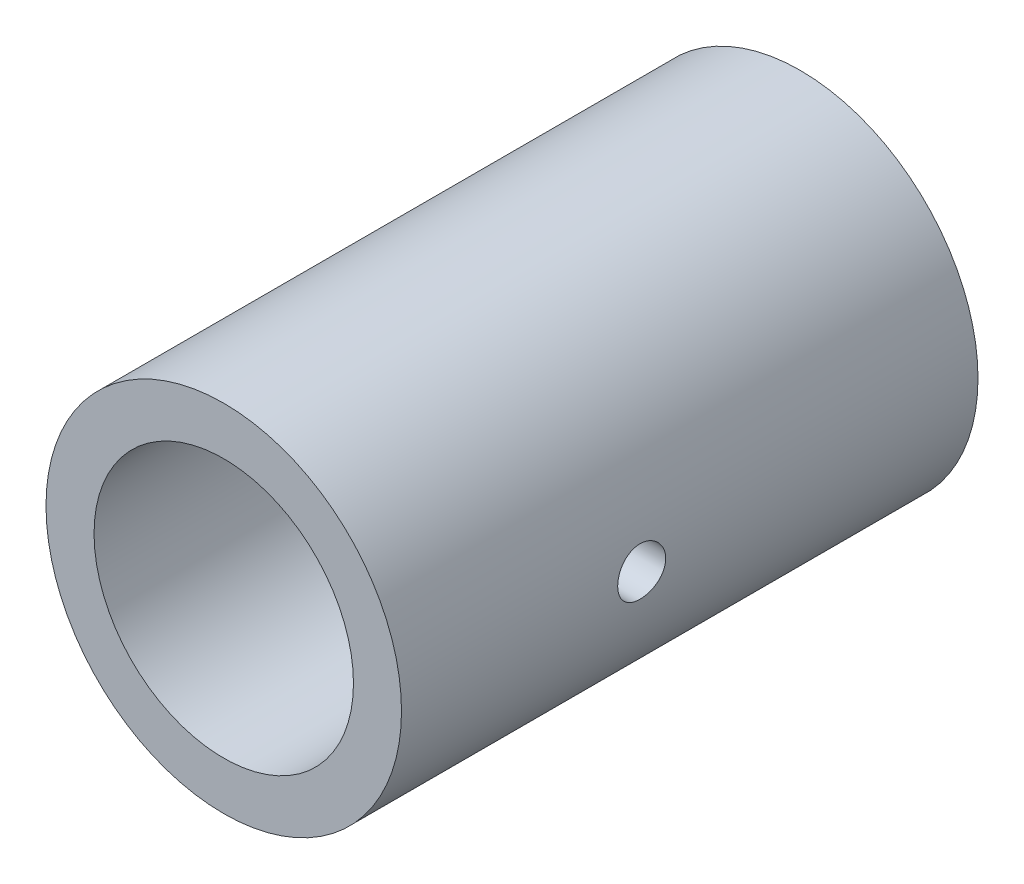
ISO-10303-21;
HEADER;
FILE_DESCRIPTION(('STEP AP214'),'2;1');
FILE_NAME('part.step','',(''),(''),'','','');
FILE_SCHEMA(('AUTOMOTIVE_DESIGN { 1 0 10303 214 1 1 1 1 }'));
ENDSEC;
DATA;
#1=APPLICATION_CONTEXT('core data for automotive mechanical design processes');
#2=APPLICATION_PROTOCOL_DEFINITION('international standard','automotive_design',2000,#1);
#3=PRODUCT_CONTEXT('',#1,'mechanical');
#4=PRODUCT('Part','Part','',(#3));
#5=PRODUCT_RELATED_PRODUCT_CATEGORY('part','',(#4));
#6=PRODUCT_DEFINITION_FORMATION('','',#4);
#7=PRODUCT_DEFINITION_CONTEXT('part definition',#1,'design');
#8=PRODUCT_DEFINITION('design','',#6,#7);
#9=PRODUCT_DEFINITION_SHAPE('','',#8);
#10=(LENGTH_UNIT() NAMED_UNIT(*) SI_UNIT(.MILLI.,.METRE.));
#11=(NAMED_UNIT(*) PLANE_ANGLE_UNIT() SI_UNIT($,.RADIAN.));
#12=(NAMED_UNIT(*) SI_UNIT($,.STERADIAN.) SOLID_ANGLE_UNIT());
#13=UNCERTAINTY_MEASURE_WITH_UNIT(LENGTH_MEASURE(1.E-05),#10,'distance_accuracy_value','');
#14=(GEOMETRIC_REPRESENTATION_CONTEXT(3) GLOBAL_UNCERTAINTY_ASSIGNED_CONTEXT((#13)) GLOBAL_UNIT_ASSIGNED_CONTEXT((#10,
#11,#12)) REPRESENTATION_CONTEXT('',''));
#15=CARTESIAN_POINT('',(0.,0.,0.));
#16=DIRECTION('',(0.,0.,1.));
#17=DIRECTION('',(1.,0.,0.));
#18=AXIS2_PLACEMENT_3D('',#15,#16,#17);
#19=CARTESIAN_POINT('',(0.,0.,65.));
#20=DIRECTION('',(0.,0.,-1.));
#21=DIRECTION('',(-1.,0.,0.));
#22=AXIS2_PLACEMENT_3D('',#19,#20,#21);
#23=CYLINDRICAL_SURFACE('',#22,18.5);
#24=CARTESIAN_POINT('',(18.5,0.,37.5));
#25=CARTESIAN_POINT('',(18.4999979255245,-0.139743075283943,37.5000058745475));
#26=CARTESIAN_POINT('',(18.498399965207,-0.279571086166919,37.5117564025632));
#27=CARTESIAN_POINT('',(18.4921791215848,-0.555329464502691,37.558442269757));
#28=CARTESIAN_POINT('',(18.4875531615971,-0.691255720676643,37.5934011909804));
#29=CARTESIAN_POINT('',(18.4757969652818,-0.955179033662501,37.685449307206));
#30=CARTESIAN_POINT('',(18.4686684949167,-1.08318160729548,37.7425228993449));
#31=CARTESIAN_POINT('',(18.4526981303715,-1.32776976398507,37.8771445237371));
#32=CARTESIAN_POINT('',(18.4438565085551,-1.44435715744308,37.9546893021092));
#33=CARTESIAN_POINT('',(18.4253822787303,-1.66357332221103,38.1285813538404));
#34=CARTESIAN_POINT('',(18.4157454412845,-1.76611856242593,38.2250334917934));
#35=CARTESIAN_POINT('',(18.3968006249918,-1.95361961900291,38.4337769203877));
#36=CARTESIAN_POINT('',(18.3874926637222,-2.03857449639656,38.546069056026));
#37=CARTESIAN_POINT('',(18.3702181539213,-2.18880006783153,38.7838551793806));
#38=CARTESIAN_POINT('',(18.3622570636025,-2.25399147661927,38.909399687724));
#39=CARTESIAN_POINT('',(18.34863433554,-2.36233311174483,39.1697808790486));
#40=CARTESIAN_POINT('',(18.3429725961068,-2.40548431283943,39.3046171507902));
#41=CARTESIAN_POINT('',(18.3346305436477,-2.46826453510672,39.5788825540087));
#42=CARTESIAN_POINT('',(18.3319322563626,-2.48803542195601,39.7182786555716));
#43=CARTESIAN_POINT('',(18.3297678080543,-2.5039329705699,39.9984342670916));
#44=CARTESIAN_POINT('',(18.3303014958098,-2.5000607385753,40.1391937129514));
#45=CARTESIAN_POINT('',(18.3345242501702,-2.46889821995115,40.4170865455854));
#46=CARTESIAN_POINT('',(18.3381921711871,-2.44176486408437,40.5542378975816));
#47=CARTESIAN_POINT('',(18.3482371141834,-2.36509547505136,40.8220228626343));
#48=CARTESIAN_POINT('',(18.3546141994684,-2.3155589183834,40.9526563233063));
#49=CARTESIAN_POINT('',(18.3693826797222,-2.19532271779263,41.2041809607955));
#50=CARTESIAN_POINT('',(18.3777804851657,-2.12455554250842,41.3250394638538));
#51=CARTESIAN_POINT('',(18.39563936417,-1.96391514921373,41.5532251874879));
#52=CARTESIAN_POINT('',(18.4051004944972,-1.87404091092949,41.6605516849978));
#53=CARTESIAN_POINT('',(18.4241137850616,-1.67687105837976,41.8595371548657));
#54=CARTESIAN_POINT('',(18.4336660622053,-1.56944030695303,41.9510622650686));
#55=CARTESIAN_POINT('',(18.4517139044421,-1.34067046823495,42.1148023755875));
#56=CARTESIAN_POINT('',(18.4602094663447,-1.21933133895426,42.1870173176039));
#57=CARTESIAN_POINT('',(18.4751932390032,-0.9660809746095,42.3100898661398));
#58=CARTESIAN_POINT('',(18.481680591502,-0.834165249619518,42.3609383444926));
#59=CARTESIAN_POINT('',(18.4919094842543,-0.563560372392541,42.4397244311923));
#60=CARTESIAN_POINT('',(18.4956511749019,-0.424871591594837,42.4676632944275));
#61=CARTESIAN_POINT('',(18.4999474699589,-0.145814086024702,42.4996618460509));
#62=CARTESIAN_POINT('',(18.5005266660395,-0.00546685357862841,42.5039057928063));
#63=CARTESIAN_POINT('',(18.498499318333,0.273936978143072,42.4888813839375));
#64=CARTESIAN_POINT('',(18.4958928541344,0.412993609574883,42.4696136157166));
#65=CARTESIAN_POINT('',(18.4878023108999,0.685319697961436,42.4082658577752));
#66=CARTESIAN_POINT('',(18.4823294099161,0.818609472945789,42.3662744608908));
#67=CARTESIAN_POINT('',(18.4691182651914,1.07625588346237,42.2607640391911));
#68=CARTESIAN_POINT('',(18.4613799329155,1.20061216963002,42.1972441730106));
#69=CARTESIAN_POINT('',(18.4444382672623,1.43767964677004,42.0500393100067));
#70=CARTESIAN_POINT('',(18.4352264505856,1.55031675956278,41.9662360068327));
#71=CARTESIAN_POINT('',(18.4163928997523,1.75999308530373,41.7810094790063));
#72=CARTESIAN_POINT('',(18.406771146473,1.85703156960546,41.6795854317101));
#73=CARTESIAN_POINT('',(18.3881254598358,2.03341626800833,41.4611814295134));
#74=CARTESIAN_POINT('',(18.3791059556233,2.11263980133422,41.3441019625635));
#75=CARTESIAN_POINT('',(18.3627610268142,2.25029621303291,41.0981898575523));
#76=CARTESIAN_POINT('',(18.3554355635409,2.30872956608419,40.969357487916));
#77=CARTESIAN_POINT('',(18.3433390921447,2.40295152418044,40.703980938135));
#78=CARTESIAN_POINT('',(18.3385604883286,2.43880752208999,40.5674610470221));
#79=CARTESIAN_POINT('',(18.3320776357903,2.48707307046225,40.2902687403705));
#80=CARTESIAN_POINT('',(18.3303732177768,2.49948391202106,40.149596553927));
#81=CARTESIAN_POINT('',(18.3302372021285,2.50048045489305,39.8693141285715));
#82=CARTESIAN_POINT('',(18.3317791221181,2.48925893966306,39.7297045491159));
#83=CARTESIAN_POINT('',(18.3379048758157,2.44371942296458,39.4543760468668));
#84=CARTESIAN_POINT('',(18.3424887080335,2.4094014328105,39.3186571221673));
#85=CARTESIAN_POINT('',(18.3541732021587,2.31870650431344,39.054998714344));
#86=CARTESIAN_POINT('',(18.3612726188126,2.26234047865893,38.927055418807));
#87=CARTESIAN_POINT('',(18.3771901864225,2.1291684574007,38.682411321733));
#88=CARTESIAN_POINT('',(18.3860083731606,2.05236203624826,38.5657107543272));
#89=CARTESIAN_POINT('',(18.4044559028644,1.87977968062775,38.3458814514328));
#90=CARTESIAN_POINT('',(18.4140910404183,1.78386034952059,38.2428657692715));
#91=CARTESIAN_POINT('',(18.4330367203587,1.57607652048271,38.0543212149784));
#92=CARTESIAN_POINT('',(18.4423471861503,1.46420829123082,37.9687964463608));
#93=CARTESIAN_POINT('',(18.4596408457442,1.22712585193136,37.817331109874));
#94=CARTESIAN_POINT('',(18.4676179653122,1.10185461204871,37.7514791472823));
#95=CARTESIAN_POINT('',(18.4812855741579,0.841988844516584,37.641843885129));
#96=CARTESIAN_POINT('',(18.4869785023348,0.707404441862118,37.5980370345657));
#97=CARTESIAN_POINT('',(18.4940917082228,0.476798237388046,37.5440126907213));
#98=CARTESIAN_POINT('',(18.496296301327,0.382219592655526,37.5275322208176));
#99=CARTESIAN_POINT('',(18.4992511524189,0.191773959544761,37.5055239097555));
#100=CARTESIAN_POINT('',(18.500001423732,0.0959069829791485,37.499995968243));
#101=CARTESIAN_POINT('',(18.5,0.,37.5));
#102=B_SPLINE_CURVE_WITH_KNOTS('',3,(#24,#25,#26,#27,#28,#29,#30,#31,#32,#33,#34,#35,#36,#37,
#38,#39,#40,#41,#42,#43,#44,#45,#46,#47,#48,#49,#50,#51,#52,#53,#54,#55,#56,#57,#58,#59,#60,#61,
#62,#63,#64,#65,#66,#67,#68,#69,#70,#71,#72,#73,#74,#75,#76,#77,#78,#79,#80,#81,#82,#83,#84,#85,
#86,#87,#88,#89,#90,#91,#92,#93,#94,#95,#96,#97,#98,#99,#100,#101),.UNSPECIFIED.,.T.,.F.,(4,2,2,
2,2,2,2,2,2,2,2,2,2,2,2,2,2,2,2,2,2,2,2,2,2,2,2,2,2,2,2,2,2,2,2,2,2,2,4),(0.,0.41887885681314,
0.838183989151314,1.25719382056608,1.67613709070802,2.09747324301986,2.51883188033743,
2.94185917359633,3.36486775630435,3.78529624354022,4.20570505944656,4.62329971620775,
5.04090413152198,5.45985122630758,5.87882069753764,6.30118173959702,6.72354405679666,
7.14608663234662,7.56860606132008,7.98783523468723,8.40705393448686,8.82464987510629,
9.24226213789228,9.66237151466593,10.0825005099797,10.5054396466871,10.9283691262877,
11.3500301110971,11.7716678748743,12.1898794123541,12.608090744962,13.0260953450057,
13.4441086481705,13.8653849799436,14.2867600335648,14.7100052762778,15.1327973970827,
15.4202805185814,15.7077610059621),.UNSPECIFIED.);
#103=CARTESIAN_POINT('',(18.5,0.,37.5));
#104=VERTEX_POINT('',#103);
#105=EDGE_CURVE('E184',#104,#104,#102,.T.);
#106=ORIENTED_EDGE('',*,*,#105,.T.);
#107=EDGE_LOOP('',(#106));
#108=FACE_BOUND('',#107,.T.);
#109=CARTESIAN_POINT('',(0.,0.,65.));
#110=DIRECTION('',(0.,0.,1.));
#111=DIRECTION('',(1.,0.,0.));
#112=AXIS2_PLACEMENT_3D('',#109,#110,#111);
#113=CIRCLE('',#112,18.5);
#114=CARTESIAN_POINT('',(18.5,0.,65.));
#115=VERTEX_POINT('',#114);
#116=EDGE_CURVE('E127',#115,#115,#113,.T.);
#117=ORIENTED_EDGE('',*,*,#116,.F.);
#118=EDGE_LOOP('',(#117));
#119=FACE_BOUND('',#118,.T.);
#120=CARTESIAN_POINT('',(0.,0.,35.));
#121=DIRECTION('',(0.,0.,-1.));
#122=DIRECTION('',(-1.,0.,0.));
#123=AXIS2_PLACEMENT_3D('',#120,#121,#122);
#124=CIRCLE('',#123,18.5);
#125=CARTESIAN_POINT('',(-2.5,-18.3303027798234,35.));
#126=VERTEX_POINT('',#125);
#127=CARTESIAN_POINT('',(2.49999999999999,-18.3303027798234,35.));
#128=VERTEX_POINT('',#127);
#129=EDGE_CURVE('E113',#126,#128,#124,.F.);
#130=ORIENTED_EDGE('',*,*,#129,.T.);
#131=CARTESIAN_POINT('',(2.49999999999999,-18.3303027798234,35.));
#132=CARTESIAN_POINT('',(2.63618878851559,-18.3117304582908,35.000000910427));
#133=CARTESIAN_POINT('',(2.77214892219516,-18.2916389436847,34.9972173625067));
#134=CARTESIAN_POINT('',(3.0433608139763,-18.2484738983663,34.9861493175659));
#135=CARTESIAN_POINT('',(3.17861262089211,-18.2254005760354,34.9778652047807));
#136=CARTESIAN_POINT('',(3.58269933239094,-18.1518352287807,34.944884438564));
#137=CARTESIAN_POINT('',(3.85012731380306,-18.0969620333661,34.9120590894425));
#138=CARTESIAN_POINT('',(4.37739256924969,-17.9766837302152,34.8258009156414));
#139=CARTESIAN_POINT('',(4.63726632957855,-17.9113452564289,34.7724956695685));
#140=CARTESIAN_POINT('',(5.14950785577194,-17.7708498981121,34.646227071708));
#141=CARTESIAN_POINT('',(5.40187446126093,-17.6956915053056,34.573260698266));
#142=CARTESIAN_POINT('',(5.89693857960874,-17.5369187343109,34.408966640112));
#143=CARTESIAN_POINT('',(6.13966097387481,-17.453328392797,34.3176904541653));
#144=CARTESIAN_POINT('',(6.61503480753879,-17.2787567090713,34.1177290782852));
#145=CARTESIAN_POINT('',(6.84768655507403,-17.1877755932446,34.0090444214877));
#146=CARTESIAN_POINT('',(7.30237146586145,-16.9995884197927,33.7751181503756));
#147=CARTESIAN_POINT('',(7.52438789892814,-16.9023730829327,33.6498515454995));
#148=CARTESIAN_POINT('',(7.95672061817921,-16.7032109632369,33.3838316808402));
#149=CARTESIAN_POINT('',(8.16703570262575,-16.601263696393,33.2430768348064));
#150=CARTESIAN_POINT('',(8.59668701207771,-16.3832503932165,32.9314562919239));
#151=CARTESIAN_POINT('',(8.81467297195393,-16.2668214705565,32.7589811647));
#152=CARTESIAN_POINT('',(9.23488136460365,-16.0319956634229,32.3971770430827));
#153=CARTESIAN_POINT('',(9.43710850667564,-15.9135993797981,32.2078531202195));
#154=CARTESIAN_POINT('',(9.82542509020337,-15.6768232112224,31.8128506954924));
#155=CARTESIAN_POINT('',(10.0114974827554,-15.5584434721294,31.6071553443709));
#156=CARTESIAN_POINT('',(10.3665350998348,-15.324169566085,31.1801865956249));
#157=CARTESIAN_POINT('',(10.5355018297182,-15.2082751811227,30.9589145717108));
#158=CARTESIAN_POINT('',(10.8417606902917,-14.991276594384,30.5208870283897));
#159=CARTESIAN_POINT('',(10.9805262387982,-14.8897558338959,30.3053680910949));
#160=CARTESIAN_POINT('',(11.2421990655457,-14.6931865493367,29.8621160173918));
#161=CARTESIAN_POINT('',(11.3651092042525,-14.5981368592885,29.6343850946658));
#162=CARTESIAN_POINT('',(11.5936527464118,-14.417294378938,29.1680503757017));
#163=CARTESIAN_POINT('',(11.6993496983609,-14.3314679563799,28.929490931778));
#164=CARTESIAN_POINT('',(11.8928327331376,-14.1713201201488,28.4414487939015));
#165=CARTESIAN_POINT('',(11.9806201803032,-14.0969978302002,28.1919669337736));
#166=CARTESIAN_POINT('',(12.1299285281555,-13.9686666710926,27.7061260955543));
#167=CARTESIAN_POINT('',(12.1931003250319,-13.9134329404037,27.4706007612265));
#168=CARTESIAN_POINT('',(12.3024627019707,-13.8168283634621,26.9929205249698));
#169=CARTESIAN_POINT('',(12.3486597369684,-13.7754522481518,26.7507681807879));
#170=CARTESIAN_POINT('',(12.4236196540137,-13.707891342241,26.2587125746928));
#171=CARTESIAN_POINT('',(12.4521767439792,-13.681886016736,26.0087522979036));
#172=CARTESIAN_POINT('',(12.4808249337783,-13.6557370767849,25.6317332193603));
#173=CARTESIAN_POINT('',(12.4880098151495,-13.649163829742,25.5055992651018));
#174=CARTESIAN_POINT('',(12.4975987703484,-13.6403829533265,25.2529845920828));
#175=CARTESIAN_POINT('',(12.5000023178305,-13.6381758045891,25.1265038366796));
#176=CARTESIAN_POINT('',(12.5,-13.6381816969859,25.));
#177=B_SPLINE_CURVE_WITH_KNOTS('',3,(#131,#132,#133,#134,#135,#136,#137,#138,#139,#140,#141,
#142,#143,#144,#145,#146,#147,#148,#149,#150,#151,#152,#153,#154,#155,#156,#157,#158,#159,#160,
#161,#162,#163,#164,#165,#166,#167,#168,#169,#170,#171,#172,#173,#174,#175,#176),.UNSPECIFIED.,
.F.,.F.,(4,2,2,2,2,2,2,2,2,2,2,2,2,2,2,2,2,2,2,2,2,2,4),(0.,0.412270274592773,0.824511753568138,
1.64820502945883,2.4668482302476,3.28561731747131,4.10211500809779,4.91858769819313,
5.73630520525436,6.55410653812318,7.4572809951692,8.36018450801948,9.26402960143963,
10.1677950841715,10.99414801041,11.8203516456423,12.6434323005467,13.4664502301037,
14.2155547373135,14.9643740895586,15.7217720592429,16.1011546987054,16.4805790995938),.UNSPECIFIED.);
#178=CARTESIAN_POINT('',(12.5,-13.6381816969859,25.));
#179=VERTEX_POINT('',#178);
#180=EDGE_CURVE('E146',#128,#179,#177,.T.);
#181=ORIENTED_EDGE('',*,*,#180,.T.);
#182=DIRECTION('',(0.,0.,-1.));
#183=VECTOR('',#182,1.);
#184=CARTESIAN_POINT('',(12.5,-13.6381816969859,65.));
#185=LINE('',#184,#183);
#186=CARTESIAN_POINT('',(12.5,-13.6381816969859,5.));
#187=VERTEX_POINT('',#186);
#188=EDGE_CURVE('E123',#179,#187,#185,.T.);
#189=ORIENTED_EDGE('',*,*,#188,.T.);
#190=CARTESIAN_POINT('',(0.,0.,5.));
#191=DIRECTION('',(0.,0.,1.));
#192=DIRECTION('',(1.,0.,0.));
#193=AXIS2_PLACEMENT_3D('',#190,#191,#192);
#194=CIRCLE('',#193,18.5);
#195=CARTESIAN_POINT('',(-12.5,-13.6381816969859,5.));
#196=VERTEX_POINT('',#195);
#197=EDGE_CURVE('E106',#187,#196,#194,.T.);
#198=ORIENTED_EDGE('',*,*,#197,.T.);
#199=DIRECTION('',(0.,0.,-1.));
#200=VECTOR('',#199,1.);
#201=CARTESIAN_POINT('',(-12.5,-13.6381816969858,65.));
#202=LINE('',#201,#200);
#203=CARTESIAN_POINT('',(-12.5,-13.6381816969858,25.));
#204=VERTEX_POINT('',#203);
#205=EDGE_CURVE('E112',#196,#204,#202,.F.);
#206=ORIENTED_EDGE('',*,*,#205,.T.);
#207=CARTESIAN_POINT('',(-12.5,-13.6381816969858,25.));
#208=CARTESIAN_POINT('',(-12.5000019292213,-13.6381767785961,25.1210552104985));
#209=CARTESIAN_POINT('',(-12.4978012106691,-13.6401973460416,25.2420901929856));
#210=CARTESIAN_POINT('',(-12.4890194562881,-13.6482396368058,25.4838572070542));
#211=CARTESIAN_POINT('',(-12.4824388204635,-13.6542609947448,25.6045892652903));
#212=CARTESIAN_POINT('',(-12.4561903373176,-13.6782279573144,25.9656068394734));
#213=CARTESIAN_POINT('',(-12.4300157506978,-13.7020767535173,26.2050807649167));
#214=CARTESIAN_POINT('',(-12.3612006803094,-13.7641859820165,26.6772371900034));
#215=CARTESIAN_POINT('',(-12.3187243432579,-13.8023026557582,26.909963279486));
#216=CARTESIAN_POINT('',(-12.218066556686,-13.8914853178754,27.3694994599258));
#217=CARTESIAN_POINT('',(-12.1598809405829,-13.9425547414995,27.5963079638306));
#218=CARTESIAN_POINT('',(-12.0290225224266,-14.0556050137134,28.0415981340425));
#219=CARTESIAN_POINT('',(-11.9564227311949,-14.117530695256,28.2601154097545));
#220=CARTESIAN_POINT('',(-11.797472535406,-14.2506285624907,28.6890868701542));
#221=CARTESIAN_POINT('',(-11.7111227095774,-14.3218003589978,28.8995413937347));
#222=CARTESIAN_POINT('',(-11.4321480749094,-14.546922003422,29.5190809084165));
#223=CARTESIAN_POINT('',(-11.2198648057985,-14.712239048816,29.915450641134));
#224=CARTESIAN_POINT('',(-10.849202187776,-14.9857669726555,30.5096463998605));
#225=CARTESIAN_POINT('',(-10.7063377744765,-15.0883345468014,30.7201711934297));
#226=CARTESIAN_POINT('',(-10.4059604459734,-15.2970379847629,31.1286197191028));
#227=CARTESIAN_POINT('',(-10.2484512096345,-15.403172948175,31.3265465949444));
#228=CARTESIAN_POINT('',(-9.91930172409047,-15.6171710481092,31.7095291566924));
#229=CARTESIAN_POINT('',(-9.74765164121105,-15.7250353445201,31.8945757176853));
#230=CARTESIAN_POINT('',(-9.39083239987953,-15.9406942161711,32.2512105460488));
#231=CARTESIAN_POINT('',(-9.2056621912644,-16.0484887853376,32.4227977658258));
#232=CARTESIAN_POINT('',(-8.78488667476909,-16.2832599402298,32.784045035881));
#233=CARTESIAN_POINT('',(-8.54648879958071,-16.4098768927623,32.9707020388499));
#234=CARTESIAN_POINT('',(-8.05195506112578,-16.6581085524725,33.3227352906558));
#235=CARTESIAN_POINT('',(-7.7958167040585,-16.7797225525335,33.488108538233));
#236=CARTESIAN_POINT('',(-7.26737612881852,-17.0152507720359,33.7957611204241));
#237=CARTESIAN_POINT('',(-6.99510487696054,-17.1291788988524,33.9380828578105));
#238=CARTESIAN_POINT('',(-6.43536156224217,-17.3472271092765,34.1982683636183));
#239=CARTESIAN_POINT('',(-6.14789163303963,-17.4513485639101,34.3161355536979));
#240=CARTESIAN_POINT('',(-5.59156950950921,-17.6369142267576,34.5141808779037));
#241=CARTESIAN_POINT('',(-5.32409186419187,-17.7195931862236,34.5970635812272));
#242=CARTESIAN_POINT('',(-4.78022143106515,-17.8739856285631,34.7406194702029));
#243=CARTESIAN_POINT('',(-4.50383114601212,-17.9457021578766,34.8012988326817));
#244=CARTESIAN_POINT('',(-3.9421613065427,-18.0774183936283,34.8995929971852));
#245=CARTESIAN_POINT('',(-3.65683481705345,-18.1373369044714,34.9370515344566));
#246=CARTESIAN_POINT('',(-3.22532814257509,-18.2172648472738,34.9747084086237));
#247=CARTESIAN_POINT('',(-3.08081533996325,-18.2422616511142,34.9841723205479));
#248=CARTESIAN_POINT('',(-2.79095612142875,-18.2888524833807,34.9968190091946));
#249=CARTESIAN_POINT('',(-2.64560963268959,-18.3104462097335,35.000001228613));
#250=CARTESIAN_POINT('',(-2.5,-18.3303027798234,35.));
#251=B_SPLINE_CURVE_WITH_KNOTS('',3,(#207,#208,#209,#210,#211,#212,#213,#214,#215,#216,#217,
#218,#219,#220,#221,#222,#223,#224,#225,#226,#227,#228,#229,#230,#231,#232,#233,#234,#235,#236,
#237,#238,#239,#240,#241,#242,#243,#244,#245,#246,#247,#248,#249,#250),.UNSPECIFIED.,.F.,.F.,(4,
2,2,2,2,2,2,2,2,2,2,2,2,2,2,2,2,2,2,2,2,4),(0.,0.3630892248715,0.726145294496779,
1.45116118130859,2.16906050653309,2.88715042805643,3.60169183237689,4.3162031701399,
5.74807980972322,6.57049963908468,7.39271342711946,8.21550389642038,9.03835834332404,
10.0217139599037,11.0052080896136,11.9868720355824,12.9683985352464,13.8431964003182,
14.7177507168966,15.5981282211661,16.0388662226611,16.4796433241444),.UNSPECIFIED.);
#252=EDGE_CURVE('E58',#204,#126,#251,.T.);
#253=ORIENTED_EDGE('',*,*,#252,.T.);
#254=EDGE_LOOP('',(#130,#181,#189,#198,#206,#253));
#255=FACE_BOUND('',#254,.T.);
#256=ADVANCED_FACE('F43',(#108,#119,#255),#23,.T.);
#257=CARTESIAN_POINT('',(0.,0.,65.));
#258=DIRECTION('',(0.,0.,-1.));
#259=DIRECTION('',(-1.,0.,0.));
#260=AXIS2_PLACEMENT_3D('',#257,#258,#259);
#261=CYLINDRICAL_SURFACE('',#260,13.5);
#262=CARTESIAN_POINT('',(13.5,0.,37.5));
#263=CARTESIAN_POINT('',(13.499997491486,-0.139151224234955,37.5000053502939));
#264=CARTESIAN_POINT('',(13.4978263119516,-0.278372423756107,37.5116570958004));
#265=CARTESIAN_POINT('',(13.4893742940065,-0.552893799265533,37.5579274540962));
#266=CARTESIAN_POINT('',(13.4830899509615,-0.688190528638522,37.5925656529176));
#267=CARTESIAN_POINT('',(13.4671148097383,-0.950852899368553,37.6837137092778));
#268=CARTESIAN_POINT('',(13.4574270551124,-1.07822550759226,37.740204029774));
#269=CARTESIAN_POINT('',(13.4357038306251,-1.32167264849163,37.8733978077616));
#270=CARTESIAN_POINT('',(13.4236685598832,-1.4377481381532,37.9500995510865));
#271=CARTESIAN_POINT('',(13.3984220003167,-1.65667582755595,38.1224913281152));
#272=CARTESIAN_POINT('',(13.3851997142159,-1.75937679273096,38.2183718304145));
#273=CARTESIAN_POINT('',(13.3591512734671,-1.94733202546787,38.4259896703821));
#274=CARTESIAN_POINT('',(13.3463251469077,-2.03258505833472,38.5377281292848));
#275=CARTESIAN_POINT('',(13.3224144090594,-2.18385077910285,38.7749553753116));
#276=CARTESIAN_POINT('',(13.3113439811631,-2.24971012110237,38.9005434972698));
#277=CARTESIAN_POINT('',(13.2923527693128,-2.35933741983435,39.1612406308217));
#278=CARTESIAN_POINT('',(13.2844317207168,-2.40310723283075,39.2963488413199));
#279=CARTESIAN_POINT('',(13.2727466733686,-2.46682866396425,39.5706344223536));
#280=CARTESIAN_POINT('',(13.2689367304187,-2.48704372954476,39.7097485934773));
#281=CARTESIAN_POINT('',(13.2657667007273,-2.50389945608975,39.9894423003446));
#282=CARTESIAN_POINT('',(13.2664062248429,-2.50054217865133,40.1300217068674));
#283=CARTESIAN_POINT('',(13.2720210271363,-2.47056225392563,40.406749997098));
#284=CARTESIAN_POINT('',(13.2769405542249,-2.44423875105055,40.5429325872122));
#285=CARTESIAN_POINT('',(13.2904735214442,-2.36954451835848,40.8089145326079));
#286=CARTESIAN_POINT('',(13.2990871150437,-2.32117287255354,40.9387136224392));
#287=CARTESIAN_POINT('',(13.3190961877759,-2.20346165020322,41.189121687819));
#288=CARTESIAN_POINT('',(13.3305076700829,-2.13400088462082,41.309672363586));
#289=CARTESIAN_POINT('',(13.3548160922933,-1.97616890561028,41.537519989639));
#290=CARTESIAN_POINT('',(13.3677131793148,-1.88779581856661,41.6448156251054));
#291=CARTESIAN_POINT('',(13.3937827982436,-1.69303294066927,41.8448361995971));
#292=CARTESIAN_POINT('',(13.4069565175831,-1.58638718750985,41.9373119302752));
#293=CARTESIAN_POINT('',(13.4319128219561,-1.35896382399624,42.1030973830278));
#294=CARTESIAN_POINT('',(13.4436953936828,-1.23818607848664,42.1764069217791));
#295=CARTESIAN_POINT('',(13.4645647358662,-0.985670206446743,42.3018140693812));
#296=CARTESIAN_POINT('',(13.4736482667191,-0.853919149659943,42.3538862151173));
#297=CARTESIAN_POINT('',(13.4880709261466,-0.583334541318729,42.4350909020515));
#298=CARTESIAN_POINT('',(13.4934104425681,-0.444501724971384,42.4642258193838));
#299=CARTESIAN_POINT('',(13.4996903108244,-0.165839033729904,42.4983831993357));
#300=CARTESIAN_POINT('',(13.5006929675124,-0.0260523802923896,42.503747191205));
#301=CARTESIAN_POINT('',(13.4983580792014,0.252420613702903,42.4911259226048));
#302=CARTESIAN_POINT('',(13.495020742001,0.391107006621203,42.4731417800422));
#303=CARTESIAN_POINT('',(13.4844196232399,0.662362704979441,42.4146187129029));
#304=CARTESIAN_POINT('',(13.4771858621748,0.794970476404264,42.3742521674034));
#305=CARTESIAN_POINT('',(13.4595996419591,1.05153614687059,42.2722963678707));
#306=CARTESIAN_POINT('',(13.4492469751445,1.17549346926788,42.2107057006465));
#307=CARTESIAN_POINT('',(13.4264159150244,1.41270014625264,42.0672910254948));
#308=CARTESIAN_POINT('',(13.4139159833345,1.52582088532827,41.9852577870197));
#309=CARTESIAN_POINT('',(13.3882335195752,1.73681333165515,41.8035702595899));
#310=CARTESIAN_POINT('',(13.3750509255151,1.83468365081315,41.7039143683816));
#311=CARTESIAN_POINT('',(13.3492828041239,2.01369114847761,41.4882658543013));
#312=CARTESIAN_POINT('',(13.3367072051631,2.09459551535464,41.3720785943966));
#313=CARTESIAN_POINT('',(13.3137750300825,2.23573895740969,41.127562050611));
#314=CARTESIAN_POINT('',(13.303418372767,2.29597878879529,40.999233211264));
#315=CARTESIAN_POINT('',(13.2861742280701,2.39375097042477,40.7346743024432));
#316=CARTESIAN_POINT('',(13.2792703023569,2.4313910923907,40.5984851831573));
#317=CARTESIAN_POINT('',(13.269675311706,2.4832286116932,40.3215763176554));
#318=CARTESIAN_POINT('',(13.2669837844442,2.49742858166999,40.1808570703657));
#319=CARTESIAN_POINT('',(13.2661413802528,2.50189828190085,39.9012135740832));
#320=CARTESIAN_POINT('',(13.2679208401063,2.49253514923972,39.7622952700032));
#321=CARTESIAN_POINT('',(13.2756656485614,2.4509470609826,39.4880490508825));
#322=CARTESIAN_POINT('',(13.2816309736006,2.41872223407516,39.3527211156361));
#323=CARTESIAN_POINT('',(13.2970463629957,2.33247878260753,39.0896881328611));
#324=CARTESIAN_POINT('',(13.3064902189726,2.27849896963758,38.961969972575));
#325=CARTESIAN_POINT('',(13.3278031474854,2.15031767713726,38.7173441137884));
#326=CARTESIAN_POINT('',(13.3396723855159,2.07611481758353,38.600437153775));
#327=CARTESIAN_POINT('',(13.3647155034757,1.9083134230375,38.3789113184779));
#328=CARTESIAN_POINT('',(13.3779059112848,1.81444734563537,38.2744969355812));
#329=CARTESIAN_POINT('',(13.4039805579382,1.6105427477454,38.0827784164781));
#330=CARTESIAN_POINT('',(13.4168647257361,1.50050051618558,37.9954782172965));
#331=CARTESIAN_POINT('',(13.44100727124,1.26621461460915,37.839754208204));
#332=CARTESIAN_POINT('',(13.4522504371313,1.14185510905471,37.7715022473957));
#333=CARTESIAN_POINT('',(13.471695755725,0.883267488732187,37.6569686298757));
#334=CARTESIAN_POINT('',(13.4799007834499,0.749048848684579,37.610666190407));
#335=CARTESIAN_POINT('',(13.4906586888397,0.512016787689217,37.5508236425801));
#336=CARTESIAN_POINT('',(13.4941420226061,0.410595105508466,37.5317971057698));
#337=CARTESIAN_POINT('',(13.4988135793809,0.20612838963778,37.5063834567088));
#338=CARTESIAN_POINT('',(13.5000018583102,0.103083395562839,37.4999960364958));
#339=CARTESIAN_POINT('',(13.5,0.,37.5));
#340=B_SPLINE_CURVE_WITH_KNOTS('',3,(#262,#263,#264,#265,#266,#267,#268,#269,#270,#271,#272,
#273,#274,#275,#276,#277,#278,#279,#280,#281,#282,#283,#284,#285,#286,#287,#288,#289,#290,#291,
#292,#293,#294,#295,#296,#297,#298,#299,#300,#301,#302,#303,#304,#305,#306,#307,#308,#309,#310,
#311,#312,#313,#314,#315,#316,#317,#318,#319,#320,#321,#322,#323,#324,#325,#326,#327,#328,#329,
#330,#331,#332,#333,#334,#335,#336,#337,#338,#339),.UNSPECIFIED.,.T.,.F.,(4,2,2,2,2,2,2,2,2,2,2,
2,2,2,2,2,2,2,2,2,2,2,2,2,2,2,2,2,2,2,2,2,2,2,2,2,2,2,4),(0.,0.417076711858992,
0.834509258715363,1.25156945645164,1.66859429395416,2.08998704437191,2.51140960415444,
2.93608000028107,3.36071470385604,3.78055306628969,4.20035471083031,4.61476855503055,
5.02919961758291,5.44605879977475,5.8629592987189,6.28626544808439,6.70957564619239,
7.13339190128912,7.55716424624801,7.9748278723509,8.39247150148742,8.80694243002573,
9.22144096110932,9.64036992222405,10.0593369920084,10.4837232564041,10.9080939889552,
11.3304246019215,11.7527088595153,12.1684543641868,12.5841975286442,12.9992022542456,
13.4142353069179,13.8353322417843,14.2565259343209,14.6814050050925,15.1058809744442,
15.4148594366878,15.7238303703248),.UNSPECIFIED.);
#341=CARTESIAN_POINT('',(13.5,0.,37.5));
#342=VERTEX_POINT('',#341);
#343=EDGE_CURVE('E221',#342,#342,#340,.T.);
#344=ORIENTED_EDGE('',*,*,#343,.F.);
#345=EDGE_LOOP('',(#344));
#346=FACE_BOUND('',#345,.T.);
#347=CARTESIAN_POINT('',(0.,0.,65.));
#348=DIRECTION('',(0.,0.,1.));
#349=DIRECTION('',(1.,0.,0.));
#350=AXIS2_PLACEMENT_3D('',#347,#348,#349);
#351=CIRCLE('',#350,13.5);
#352=CARTESIAN_POINT('',(13.5,0.,65.));
#353=VERTEX_POINT('',#352);
#354=EDGE_CURVE('E134',#353,#353,#351,.T.);
#355=ORIENTED_EDGE('',*,*,#354,.T.);
#356=EDGE_LOOP('',(#355));
#357=FACE_BOUND('',#356,.T.);
#358=CARTESIAN_POINT('',(0.,0.,5.));
#359=DIRECTION('',(0.,0.,1.));
#360=DIRECTION('',(1.,0.,0.));
#361=AXIS2_PLACEMENT_3D('',#358,#359,#360);
#362=CIRCLE('',#361,13.5);
#363=CARTESIAN_POINT('',(12.5,-5.0990195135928,5.));
#364=VERTEX_POINT('',#363);
#365=CARTESIAN_POINT('',(-12.5,-5.0990195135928,5.));
#366=VERTEX_POINT('',#365);
#367=EDGE_CURVE('E109',#364,#366,#362,.T.);
#368=ORIENTED_EDGE('',*,*,#367,.F.);
#369=DIRECTION('',(0.,0.,-1.));
#370=VECTOR('',#369,1.);
#371=CARTESIAN_POINT('',(12.5,-5.09901951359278,65.));
#372=LINE('',#371,#370);
#373=CARTESIAN_POINT('',(12.5,-5.09901951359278,25.));
#374=VERTEX_POINT('',#373);
#375=EDGE_CURVE('E201',#374,#364,#372,.T.);
#376=ORIENTED_EDGE('',*,*,#375,.F.);
#377=CARTESIAN_POINT('',(12.5,-5.09901951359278,25.));
#378=CARTESIAN_POINT('',(12.5000331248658,-5.09888201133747,25.1350436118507));
#379=CARTESIAN_POINT('',(12.4972660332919,-5.10572217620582,25.2699890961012));
#380=CARTESIAN_POINT('',(12.4864053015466,-5.13225446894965,25.5380215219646));
#381=CARTESIAN_POINT('',(12.4783268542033,-5.15190993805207,25.6711126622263));
#382=CARTESIAN_POINT('',(12.4573214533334,-5.20248264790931,25.9319876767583));
#383=CARTESIAN_POINT('',(12.4444921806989,-5.23317266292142,26.0598244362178));
#384=CARTESIAN_POINT('',(12.414338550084,-5.30430970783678,26.3122721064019));
#385=CARTESIAN_POINT('',(12.3970106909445,-5.34476433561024,26.436880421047));
#386=CARTESIAN_POINT('',(12.3489292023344,-5.4551885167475,26.741393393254));
#387=CARTESIAN_POINT('',(12.3157226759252,-5.53000700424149,26.9191479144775));
#388=CARTESIAN_POINT('',(12.2413305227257,-5.69278846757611,27.2667415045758));
#389=CARTESIAN_POINT('',(12.2001405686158,-5.78075856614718,27.4365762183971));
#390=CARTESIAN_POINT('',(12.1100769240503,-5.96714876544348,27.7706786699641));
#391=CARTESIAN_POINT('',(12.0611275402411,-6.06566833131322,27.9348698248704));
#392=CARTESIAN_POINT('',(11.9563628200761,-6.26965318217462,28.2566615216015));
#393=CARTESIAN_POINT('',(11.9005445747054,-6.37512140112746,28.4142592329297));
#394=CARTESIAN_POINT('',(11.7823414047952,-6.59102342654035,28.7236516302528));
#395=CARTESIAN_POINT('',(11.7199514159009,-6.70146102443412,28.8754417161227));
#396=CARTESIAN_POINT('',(11.5888307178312,-6.92574248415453,29.173688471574));
#397=CARTESIAN_POINT('',(11.520098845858,-7.03958696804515,29.3201441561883));
#398=CARTESIAN_POINT('',(11.3044806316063,-7.384587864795,29.7523681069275));
#399=CARTESIAN_POINT('',(11.1482286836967,-7.61910566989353,30.0308456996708));
#400=CARTESIAN_POINT('',(10.8112083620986,-8.09022672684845,30.5699795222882));
#401=CARTESIAN_POINT('',(10.6304630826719,-8.3268278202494,30.8306521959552));
#402=CARTESIAN_POINT('',(10.2440762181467,-8.79782134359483,31.3348318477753));
#403=CARTESIAN_POINT('',(10.0384426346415,-9.03221445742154,31.5783443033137));
#404=CARTESIAN_POINT('',(9.58989784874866,-9.50770330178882,32.0602756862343));
#405=CARTESIAN_POINT('',(9.34557032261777,-9.74847380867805,32.2977032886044));
#406=CARTESIAN_POINT('',(8.8279855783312,-10.2195472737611,32.7507991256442));
#407=CARTESIAN_POINT('',(8.55471960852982,-10.4498470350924,32.9664607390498));
#408=CARTESIAN_POINT('',(7.97980119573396,-10.8951669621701,33.3722916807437));
#409=CARTESIAN_POINT('',(7.67822506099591,-11.1102256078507,33.5625263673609));
#410=CARTESIAN_POINT('',(7.04657354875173,-11.5211752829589,33.9139805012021));
#411=CARTESIAN_POINT('',(6.71652187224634,-11.7170819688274,34.0752237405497));
#412=CARTESIAN_POINT('',(6.16134683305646,-12.0143895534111,34.3084530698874));
#413=CARTESIAN_POINT('',(5.9445449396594,-12.1232134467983,34.3909502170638));
#414=CARTESIAN_POINT('',(5.50132251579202,-12.3306639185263,34.5418465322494));
#415=CARTESIAN_POINT('',(5.27490260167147,-12.4292911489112,34.6102466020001));
#416=CARTESIAN_POINT('',(4.81398271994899,-12.6149575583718,34.7315021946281));
#417=CARTESIAN_POINT('',(4.57950391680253,-12.7020245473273,34.7843954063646));
#418=CARTESIAN_POINT('',(4.10330883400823,-12.8637487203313,34.8736027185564));
#419=CARTESIAN_POINT('',(3.86159618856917,-12.9384120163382,34.9099249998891));
#420=CARTESIAN_POINT('',(3.43354613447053,-13.0574513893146,34.9580415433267));
#421=CARTESIAN_POINT('',(3.24844099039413,-13.1047361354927,34.973694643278));
#422=CARTESIAN_POINT('',(2.87582461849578,-13.1915254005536,34.9946810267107));
#423=CARTESIAN_POINT('',(2.68831319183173,-13.2310292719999,35.0000134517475));
#424=CARTESIAN_POINT('',(2.49999999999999,-13.2664991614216,35.));
#425=B_SPLINE_CURVE_WITH_KNOTS('',3,(#377,#378,#379,#380,#381,#382,#383,#384,#385,#386,#387,
#388,#389,#390,#391,#392,#393,#394,#395,#396,#397,#398,#399,#400,#401,#402,#403,#404,#405,#406,
#407,#408,#409,#410,#411,#412,#413,#414,#415,#416,#417,#418,#419,#420,#421,#422,#423,#424),
.UNSPECIFIED.,.F.,.F.,(4,2,2,2,2,2,2,2,2,2,2,2,2,2,2,2,2,2,2,2,2,2,2,4),(0.,0.404772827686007,
0.808392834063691,1.20413731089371,1.60019071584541,2.18624272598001,2.77261329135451,
3.36510252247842,3.95784354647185,4.55104474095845,5.14435491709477,6.33154477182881,
7.51762293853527,8.70332078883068,9.95327984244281,11.2036179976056,12.4506777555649,
13.6967093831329,14.4647195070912,15.2326804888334,15.9987591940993,16.7644592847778,
17.3390970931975,17.9137826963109),.UNSPECIFIED.);
#426=CARTESIAN_POINT('',(2.49999999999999,-13.2664991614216,35.));
#427=VERTEX_POINT('',#426);
#428=EDGE_CURVE('E154',#374,#427,#425,.T.);
#429=ORIENTED_EDGE('',*,*,#428,.T.);
#430=CARTESIAN_POINT('',(0.,0.,35.));
#431=DIRECTION('',(0.,0.,-1.));
#432=DIRECTION('',(-1.,0.,0.));
#433=AXIS2_PLACEMENT_3D('',#430,#431,#432);
#434=CIRCLE('',#433,13.5);
#435=CARTESIAN_POINT('',(-2.5,-13.2664991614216,35.));
#436=VERTEX_POINT('',#435);
#437=EDGE_CURVE('E197',#436,#427,#434,.F.);
#438=ORIENTED_EDGE('',*,*,#437,.F.);
#439=CARTESIAN_POINT('',(-2.5,-13.2664991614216,35.));
#440=CARTESIAN_POINT('',(-2.63063583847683,-13.2418838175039,35.0000015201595));
#441=CARTESIAN_POINT('',(-2.7608841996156,-13.2153382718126,34.9974395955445));
#442=CARTESIAN_POINT('',(-3.02034119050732,-13.1584637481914,34.9872967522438));
#443=CARTESIAN_POINT('',(-3.14954993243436,-13.1281351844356,34.9797163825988));
#444=CARTESIAN_POINT('',(-3.53492010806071,-13.0316673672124,34.9496352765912));
#445=CARTESIAN_POINT('',(-3.78917460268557,-12.9599800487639,34.9197939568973));
#446=CARTESIAN_POINT('',(-4.28821452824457,-12.8034783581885,34.8420298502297));
#447=CARTESIAN_POINT('',(-4.5330631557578,-12.7187837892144,34.7942668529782));
#448=CARTESIAN_POINT('',(-5.01416953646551,-12.5369155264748,34.6819410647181));
#449=CARTESIAN_POINT('',(-5.2504251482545,-12.4397387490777,34.6173741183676));
#450=CARTESIAN_POINT('',(-5.71208022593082,-12.2346098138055,34.4731609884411));
#451=CARTESIAN_POINT('',(-5.93752281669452,-12.1267068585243,34.3935822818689));
#452=CARTESIAN_POINT('',(-6.3778321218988,-11.9010277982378,34.2205409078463));
#453=CARTESIAN_POINT('',(-6.59269960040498,-11.7832524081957,34.1270792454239));
#454=CARTESIAN_POINT('',(-7.0118338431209,-11.5387687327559,33.9273386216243));
#455=CARTESIAN_POINT('',(-7.21607534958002,-11.4120407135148,33.8210309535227));
#456=CARTESIAN_POINT('',(-7.61316644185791,-11.1510616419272,33.5969484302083));
#457=CARTESIAN_POINT('',(-7.80601348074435,-11.0168089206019,33.4791710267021));
#458=CARTESIAN_POINT('',(-8.27034844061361,-10.6756569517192,33.1739324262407));
#459=CARTESIAN_POINT('',(-8.53495537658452,-10.4649231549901,32.9802391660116));
#460=CARTESIAN_POINT('',(-9.03893933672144,-10.0328383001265,32.5728046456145));
#461=CARTESIAN_POINT('',(-9.27830470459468,-9.81148240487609,32.359054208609));
#462=CARTESIAN_POINT('',(-9.73258253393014,-9.36105437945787,31.91312289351));
#463=CARTESIAN_POINT('',(-9.94744397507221,-9.13196739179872,31.6809052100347));
#464=CARTESIAN_POINT('',(-10.3525809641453,-8.66997035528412,31.1996707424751));
#465=CARTESIAN_POINT('',(-10.5428640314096,-8.43706150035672,30.950659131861));
#466=CARTESIAN_POINT('',(-10.8707906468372,-8.00853336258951,30.4771338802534));
#467=CARTESIAN_POINT('',(-11.0119856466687,-7.81290852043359,30.2550727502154));
#468=CARTESIAN_POINT('',(-11.2774968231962,-7.42451157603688,29.7984736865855));
#469=CARTESIAN_POINT('',(-11.4018064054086,-7.23174061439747,29.5639309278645));
#470=CARTESIAN_POINT('',(-11.6330614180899,-6.85353058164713,29.0815038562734));
#471=CARTESIAN_POINT('',(-11.7400375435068,-6.66807899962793,28.8336441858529));
#472=CARTESIAN_POINT('',(-11.9360740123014,-6.31043177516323,28.3219729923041));
#473=CARTESIAN_POINT('',(-12.0251541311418,-6.1382216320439,28.0581795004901));
#474=CARTESIAN_POINT('',(-12.1751782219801,-5.83442610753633,27.540764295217));
#475=CARTESIAN_POINT('',(-12.2381270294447,-5.700459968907,27.2891483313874));
#476=CARTESIAN_POINT('',(-12.3457808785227,-5.46338667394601,26.7692453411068));
#477=CARTESIAN_POINT('',(-12.3906050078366,-5.36007931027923,26.501080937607));
#478=CARTESIAN_POINT('',(-12.4368277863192,-5.25131375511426,26.126633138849));
#479=CARTESIAN_POINT('',(-12.4476060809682,-5.22567658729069,26.0272668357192));
#480=CARTESIAN_POINT('',(-12.4662686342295,-5.18099659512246,25.8268080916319));
#481=CARTESIAN_POINT('',(-12.4741539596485,-5.16195134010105,25.725716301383));
#482=CARTESIAN_POINT('',(-12.4869535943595,-5.13091561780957,25.520953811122));
#483=CARTESIAN_POINT('',(-12.491829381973,-5.11901667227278,25.417266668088));
#484=CARTESIAN_POINT('',(-12.4983609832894,-5.10303719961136,25.2090633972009));
#485=CARTESIAN_POINT('',(-12.50001271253,-5.09896659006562,25.1045463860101));
#486=CARTESIAN_POINT('',(-12.5,-5.0990195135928,25.));
#487=B_SPLINE_CURVE_WITH_KNOTS('',3,(#439,#440,#441,#442,#443,#444,#445,#446,#447,#448,#449,
#450,#451,#452,#453,#454,#455,#456,#457,#458,#459,#460,#461,#462,#463,#464,#465,#466,#467,#468,
#469,#470,#471,#472,#473,#474,#475,#476,#477,#478,#479,#480,#481,#482,#483,#484,#485,#486),
.UNSPECIFIED.,.F.,.F.,(4,2,2,2,2,2,2,2,2,2,2,2,2,2,2,2,2,2,2,2,2,2,2,4),(0.,0.398720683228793,
0.797397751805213,1.59369040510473,2.38304579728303,3.17259656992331,3.95867945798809,
4.74470546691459,5.53252165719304,6.32051328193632,7.48819117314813,8.65640594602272,
9.82701031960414,10.9972557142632,11.9803151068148,12.9637573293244,13.9454385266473,
14.926028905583,15.8001430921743,16.6684167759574,16.9777539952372,17.28697702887,
17.6000801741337,17.9135797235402),.UNSPECIFIED.);
#488=CARTESIAN_POINT('',(-12.5,-5.09901951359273,25.));
#489=VERTEX_POINT('',#488);
#490=EDGE_CURVE('E11',#436,#489,#487,.T.);
#491=ORIENTED_EDGE('',*,*,#490,.T.);
#492=DIRECTION('',(0.,0.,-1.));
#493=VECTOR('',#492,1.);
#494=CARTESIAN_POINT('',(-12.5,-5.09901951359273,65.));
#495=LINE('',#494,#493);
#496=EDGE_CURVE('E202',#366,#489,#495,.F.);
#497=ORIENTED_EDGE('',*,*,#496,.F.);
#498=EDGE_LOOP('',(#368,#376,#429,#438,#491,#497));
#499=FACE_BOUND('',#498,.T.);
#500=ADVANCED_FACE('F174',(#346,#357,#499),#261,.F.);
#501=CARTESIAN_POINT('',(0.,0.,65.));
#502=DIRECTION('',(0.,0.,1.));
#503=DIRECTION('',(1.,0.,0.));
#504=AXIS2_PLACEMENT_3D('',#501,#502,#503);
#505=PLANE('',#504);
#506=ORIENTED_EDGE('',*,*,#116,.T.);
#507=EDGE_LOOP('',(#506));
#508=FACE_BOUND('',#507,.T.);
#509=ORIENTED_EDGE('',*,*,#354,.F.);
#510=EDGE_LOOP('',(#509));
#511=FACE_BOUND('',#510,.T.);
#512=ADVANCED_FACE('F179',(#508,#511),#505,.T.);
#513=CARTESIAN_POINT('',(12.5,100.001,5.));
#514=DIRECTION('',(-1.,0.,0.));
#515=DIRECTION('',(0.,0.,1.));
#516=AXIS2_PLACEMENT_3D('',#513,#514,#515);
#517=PLANE('',#516);
#518=ORIENTED_EDGE('',*,*,#188,.F.);
#519=DIRECTION('',(0.,-1.,0.));
#520=VECTOR('',#519,1.);
#521=CARTESIAN_POINT('',(12.5,-5.09901951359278,25.));
#522=LINE('',#521,#520);
#523=EDGE_CURVE('E141',#179,#374,#522,.F.);
#524=ORIENTED_EDGE('',*,*,#523,.T.);
#525=ORIENTED_EDGE('',*,*,#375,.T.);
#526=DIRECTION('',(0.,-1.,0.));
#527=VECTOR('',#526,1.);
#528=CARTESIAN_POINT('',(12.5,100.001,5.));
#529=LINE('',#528,#527);
#530=EDGE_CURVE('E205',#364,#187,#529,.T.);
#531=ORIENTED_EDGE('',*,*,#530,.T.);
#532=EDGE_LOOP('',(#518,#524,#525,#531));
#533=FACE_BOUND('',#532,.T.);
#534=ADVANCED_FACE('F189',(#533),#517,.T.);
#535=CARTESIAN_POINT('',(-12.5,100.001,35.));
#536=DIRECTION('',(0.,0.,-1.));
#537=DIRECTION('',(-1.,0.,0.));
#538=AXIS2_PLACEMENT_3D('',#535,#536,#537);
#539=PLANE('',#538);
#540=ORIENTED_EDGE('',*,*,#437,.T.);
#541=DIRECTION('',(0.,-1.,0.));
#542=VECTOR('',#541,1.);
#543=CARTESIAN_POINT('',(2.49999999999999,-13.6381816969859,35.));
#544=LINE('',#543,#542);
#545=EDGE_CURVE('E131',#427,#128,#544,.T.);
#546=ORIENTED_EDGE('',*,*,#545,.T.);
#547=ORIENTED_EDGE('',*,*,#129,.F.);
#548=DIRECTION('',(0.,-1.,0.));
#549=VECTOR('',#548,1.);
#550=CARTESIAN_POINT('',(-2.5,-5.09901951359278,35.));
#551=LINE('',#550,#549);
#552=EDGE_CURVE('E126',#126,#436,#551,.F.);
#553=ORIENTED_EDGE('',*,*,#552,.T.);
#554=EDGE_LOOP('',(#540,#546,#547,#553));
#555=FACE_BOUND('',#554,.T.);
#556=ADVANCED_FACE('F170',(#555),#539,.T.);
#557=CARTESIAN_POINT('',(-12.5,100.001,5.));
#558=DIRECTION('',(1.,0.,0.));
#559=DIRECTION('',(0.,0.,-1.));
#560=AXIS2_PLACEMENT_3D('',#557,#558,#559);
#561=PLANE('',#560);
#562=ORIENTED_EDGE('',*,*,#496,.T.);
#563=DIRECTION('',(0.,-1.,0.));
#564=VECTOR('',#563,1.);
#565=CARTESIAN_POINT('',(-12.5,-13.6381816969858,25.));
#566=LINE('',#565,#564);
#567=EDGE_CURVE('E117',#489,#204,#566,.T.);
#568=ORIENTED_EDGE('',*,*,#567,.T.);
#569=ORIENTED_EDGE('',*,*,#205,.F.);
#570=DIRECTION('',(0.,-1.,0.));
#571=VECTOR('',#570,1.);
#572=CARTESIAN_POINT('',(-12.5,100.001,5.));
#573=LINE('',#572,#571);
#574=EDGE_CURVE('E102',#366,#196,#573,.T.);
#575=ORIENTED_EDGE('',*,*,#574,.F.);
#576=EDGE_LOOP('',(#562,#568,#569,#575));
#577=FACE_BOUND('',#576,.T.);
#578=ADVANCED_FACE('F116',(#577),#561,.T.);
#579=CARTESIAN_POINT('',(2.5,100.001,25.));
#580=DIRECTION('',(0.,1.,0.));
#581=DIRECTION('',(0.,0.,1.));
#582=AXIS2_PLACEMENT_3D('',#579,#580,#581);
#583=CYLINDRICAL_SURFACE('',#582,10.);
#584=ORIENTED_EDGE('',*,*,#428,.F.);
#585=ORIENTED_EDGE('',*,*,#523,.F.);
#586=ORIENTED_EDGE('',*,*,#180,.F.);
#587=ORIENTED_EDGE('',*,*,#545,.F.);
#588=EDGE_LOOP('',(#584,#585,#586,#587));
#589=FACE_BOUND('',#588,.T.);
#590=ADVANCED_FACE('F161',(#589),#583,.F.);
#591=CARTESIAN_POINT('',(-2.5,100.001,25.));
#592=DIRECTION('',(0.,1.,0.));
#593=DIRECTION('',(0.,0.,1.));
#594=AXIS2_PLACEMENT_3D('',#591,#592,#593);
#595=CYLINDRICAL_SURFACE('',#594,10.);
#596=ORIENTED_EDGE('',*,*,#490,.F.);
#597=ORIENTED_EDGE('',*,*,#552,.F.);
#598=ORIENTED_EDGE('',*,*,#252,.F.);
#599=ORIENTED_EDGE('',*,*,#567,.F.);
#600=EDGE_LOOP('',(#596,#597,#598,#599));
#601=FACE_BOUND('',#600,.T.);
#602=ADVANCED_FACE('F45',(#601),#595,.F.);
#603=CARTESIAN_POINT('',(-100.,-130.,5.));
#604=DIRECTION('',(0.,0.,1.));
#605=DIRECTION('',(1.,0.,0.));
#606=AXIS2_PLACEMENT_3D('',#603,#604,#605);
#607=PLANE('',#606);
#608=ORIENTED_EDGE('',*,*,#530,.F.);
#609=ORIENTED_EDGE('',*,*,#367,.T.);
#610=ORIENTED_EDGE('',*,*,#574,.T.);
#611=ORIENTED_EDGE('',*,*,#197,.F.);
#612=EDGE_LOOP('',(#608,#609,#610,#611));
#613=FACE_BOUND('',#612,.T.);
#614=ADVANCED_FACE('F104',(#613),#607,.F.);
#615=CARTESIAN_POINT('',(18.5,0.,40.));
#616=DIRECTION('',(1.,0.,0.));
#617=DIRECTION('',(0.,0.,-1.));
#618=AXIS2_PLACEMENT_3D('',#615,#616,#617);
#619=CYLINDRICAL_SURFACE('',#618,2.5);
#620=ORIENTED_EDGE('',*,*,#343,.T.);
#621=EDGE_LOOP('',(#620));
#622=FACE_BOUND('',#621,.T.);
#623=ORIENTED_EDGE('',*,*,#105,.F.);
#624=EDGE_LOOP('',(#623));
#625=FACE_BOUND('',#624,.T.);
#626=ADVANCED_FACE('F226',(#622,#625),#619,.F.);
#627=CLOSED_SHELL('',(#256,#500,#512,#534,#556,#578,#590,#602,#614,#626));
#628=MANIFOLD_SOLID_BREP('B2',#627);
#629=ADVANCED_BREP_SHAPE_REPRESENTATION('',(#18,#628),#14);
#630=SHAPE_DEFINITION_REPRESENTATION(#9,#629);
ENDSEC;
END-ISO-10303-21;
